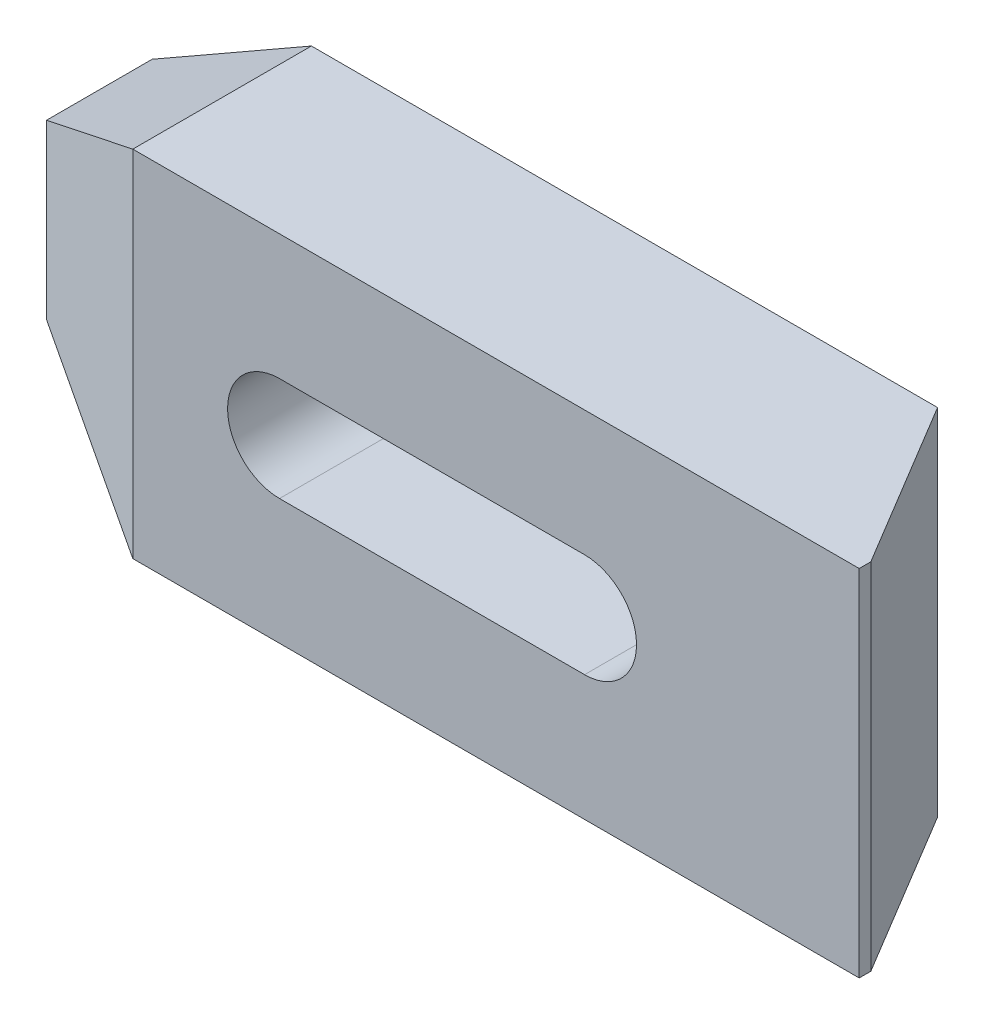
ISO-10303-21;
HEADER;
FILE_DESCRIPTION(('STEP AP214'),'2;1');
FILE_NAME('part.step','',(''),(''),'','','');
FILE_SCHEMA(('AUTOMOTIVE_DESIGN { 1 0 10303 214 1 1 1 1 }'));
ENDSEC;
DATA;
#1=APPLICATION_CONTEXT('core data for automotive mechanical design processes');
#2=APPLICATION_PROTOCOL_DEFINITION('international standard','automotive_design',2000,#1);
#3=PRODUCT_CONTEXT('',#1,'mechanical');
#4=PRODUCT('Part','Part','',(#3));
#5=PRODUCT_RELATED_PRODUCT_CATEGORY('part','',(#4));
#6=PRODUCT_DEFINITION_FORMATION('','',#4);
#7=PRODUCT_DEFINITION_CONTEXT('part definition',#1,'design');
#8=PRODUCT_DEFINITION('design','',#6,#7);
#9=PRODUCT_DEFINITION_SHAPE('','',#8);
#10=(LENGTH_UNIT() NAMED_UNIT(*) SI_UNIT(.MILLI.,.METRE.));
#11=(NAMED_UNIT(*) PLANE_ANGLE_UNIT() SI_UNIT($,.RADIAN.));
#12=(NAMED_UNIT(*) SI_UNIT($,.STERADIAN.) SOLID_ANGLE_UNIT());
#13=UNCERTAINTY_MEASURE_WITH_UNIT(LENGTH_MEASURE(1.E-05),#10,'distance_accuracy_value','');
#14=(GEOMETRIC_REPRESENTATION_CONTEXT(3) GLOBAL_UNCERTAINTY_ASSIGNED_CONTEXT((#13)) GLOBAL_UNIT_ASSIGNED_CONTEXT((#10,
#11,#12)) REPRESENTATION_CONTEXT('',''));
#15=CARTESIAN_POINT('',(0.,0.,0.));
#16=DIRECTION('',(0.,0.,1.));
#17=DIRECTION('',(1.,0.,0.));
#18=AXIS2_PLACEMENT_3D('',#15,#16,#17);
#19=CARTESIAN_POINT('',(0.,0.,12.446));
#20=DIRECTION('',(0.,0.,1.));
#21=DIRECTION('',(1.,0.,0.));
#22=AXIS2_PLACEMENT_3D('',#19,#20,#21);
#23=PLANE('',#22);
#24=DIRECTION('',(-1.,0.,0.));
#25=VECTOR('',#24,1.);
#26=CARTESIAN_POINT('',(53.73578153,12.3571,12.446));
#27=LINE('',#26,#25);
#28=CARTESIAN_POINT('',(104.35798153,12.3571,12.446));
#29=VERTEX_POINT('',#28);
#30=CARTESIAN_POINT('',(53.73578153,12.3571,12.446));
#31=VERTEX_POINT('',#30);
#32=EDGE_CURVE('E137',#29,#31,#27,.T.);
#33=ORIENTED_EDGE('',*,*,#32,.T.);
#34=DIRECTION('',(0.,-1.,0.));
#35=VECTOR('',#34,1.);
#36=CARTESIAN_POINT('',(53.7357815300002,-6.0071,12.446));
#37=LINE('',#36,#35);
#38=CARTESIAN_POINT('',(53.73578153,-12.3571,12.446));
#39=VERTEX_POINT('',#38);
#40=EDGE_CURVE('E139',#31,#39,#37,.T.);
#41=ORIENTED_EDGE('',*,*,#40,.T.);
#42=DIRECTION('',(1.,0.,0.));
#43=VECTOR('',#42,1.);
#44=CARTESIAN_POINT('',(53.73578153,-12.3571,12.446));
#45=LINE('',#44,#43);
#46=CARTESIAN_POINT('',(104.35798153,-12.3571,12.446));
#47=VERTEX_POINT('',#46);
#48=EDGE_CURVE('E173',#39,#47,#45,.T.);
#49=ORIENTED_EDGE('',*,*,#48,.T.);
#50=DIRECTION('',(0.,1.,0.));
#51=VECTOR('',#50,1.);
#52=CARTESIAN_POINT('',(104.35798153,12.3571,12.446));
#53=LINE('',#52,#51);
#54=EDGE_CURVE('E172',#47,#29,#53,.T.);
#55=ORIENTED_EDGE('',*,*,#54,.T.);
#56=EDGE_LOOP('',(#33,#41,#49,#55));
#57=FACE_BOUND('',#56,.T.);
#58=DIRECTION('',(1.,0.,0.));
#59=VECTOR('',#58,1.);
#60=CARTESIAN_POINT('',(85.21908153,-3.61949999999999,12.446));
#61=LINE('',#60,#59);
#62=CARTESIAN_POINT('',(63.95928153,-3.61949999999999,12.446));
#63=VERTEX_POINT('',#62);
#64=CARTESIAN_POINT('',(85.21908153,-3.61949999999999,12.446));
#65=VERTEX_POINT('',#64);
#66=EDGE_CURVE('E224',#63,#65,#61,.T.);
#67=ORIENTED_EDGE('',*,*,#66,.F.);
#68=CARTESIAN_POINT('',(63.95928153,0.,12.446));
#69=DIRECTION('',(0.,0.,1.));
#70=DIRECTION('',(1.,0.,0.));
#71=AXIS2_PLACEMENT_3D('',#68,#69,#70);
#72=CIRCLE('',#71,3.61949999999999);
#73=CARTESIAN_POINT('',(63.95928153,3.61949999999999,12.446));
#74=VERTEX_POINT('',#73);
#75=EDGE_CURVE('E210',#74,#63,#72,.T.);
#76=ORIENTED_EDGE('',*,*,#75,.F.);
#77=DIRECTION('',(-1.,0.,0.));
#78=VECTOR('',#77,1.);
#79=CARTESIAN_POINT('',(63.95928153,3.61949999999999,12.446));
#80=LINE('',#79,#78);
#81=CARTESIAN_POINT('',(85.21908153,3.61949999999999,12.446));
#82=VERTEX_POINT('',#81);
#83=EDGE_CURVE('E206',#82,#74,#80,.T.);
#84=ORIENTED_EDGE('',*,*,#83,.F.);
#85=CARTESIAN_POINT('',(85.21908153,0.,12.446));
#86=DIRECTION('',(0.,0.,1.));
#87=DIRECTION('',(1.,0.,0.));
#88=AXIS2_PLACEMENT_3D('',#85,#86,#87);
#89=CIRCLE('',#88,3.61949999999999);
#90=EDGE_CURVE('E221',#65,#82,#89,.T.);
#91=ORIENTED_EDGE('',*,*,#90,.F.);
#92=EDGE_LOOP('',(#67,#76,#84,#91));
#93=FACE_BOUND('',#92,.T.);
#94=ADVANCED_FACE('F35',(#57,#93),#23,.T.);
#95=CARTESIAN_POINT('',(0.,0.,0.));
#96=DIRECTION('',(0.,0.,1.));
#97=DIRECTION('',(1.,0.,0.));
#98=AXIS2_PLACEMENT_3D('',#95,#96,#97);
#99=PLANE('',#98);
#100=DIRECTION('',(-1.,0.,0.));
#101=VECTOR('',#100,1.);
#102=CARTESIAN_POINT('',(53.73578153,12.3571,0.));
#103=LINE('',#102,#101);
#104=CARTESIAN_POINT('',(97.37298153,12.3571,0.));
#105=VERTEX_POINT('',#104);
#106=CARTESIAN_POINT('',(53.73578153,12.3571,0.));
#107=VERTEX_POINT('',#106);
#108=EDGE_CURVE('E175',#105,#107,#103,.T.);
#109=ORIENTED_EDGE('',*,*,#108,.F.);
#110=DIRECTION('',(0.,-1.,0.));
#111=VECTOR('',#110,1.);
#112=CARTESIAN_POINT('',(97.37298153,12.3571,0.));
#113=LINE('',#112,#111);
#114=CARTESIAN_POINT('',(97.37298153,-12.3571,0.));
#115=VERTEX_POINT('',#114);
#116=EDGE_CURVE('E119',#105,#115,#113,.T.);
#117=ORIENTED_EDGE('',*,*,#116,.T.);
#118=DIRECTION('',(1.,0.,0.));
#119=VECTOR('',#118,1.);
#120=CARTESIAN_POINT('',(53.73578153,-12.3571,0.));
#121=LINE('',#120,#119);
#122=CARTESIAN_POINT('',(53.73578153,-12.3571,0.));
#123=VERTEX_POINT('',#122);
#124=EDGE_CURVE('E189',#123,#115,#121,.T.);
#125=ORIENTED_EDGE('',*,*,#124,.F.);
#126=DIRECTION('',(0.867998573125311,-0.496566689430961,0.));
#127=VECTOR('',#126,1.);
#128=CARTESIAN_POINT('',(42.6359815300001,-6.0071,0.));
#129=LINE('',#128,#127);
#130=CARTESIAN_POINT('',(42.6359815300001,-6.0071,0.));
#131=VERTEX_POINT('',#130);
#132=EDGE_CURVE('E187',#131,#123,#129,.T.);
#133=ORIENTED_EDGE('',*,*,#132,.F.);
#134=DIRECTION('',(0.,-1.,0.));
#135=VECTOR('',#134,1.);
#136=CARTESIAN_POINT('',(42.6359815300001,6.0071,0.));
#137=LINE('',#136,#135);
#138=CARTESIAN_POINT('',(42.6359815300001,6.0071,0.));
#139=VERTEX_POINT('',#138);
#140=EDGE_CURVE('E162',#139,#131,#137,.T.);
#141=ORIENTED_EDGE('',*,*,#140,.F.);
#142=DIRECTION('',(-0.867998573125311,-0.49656668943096,0.));
#143=VECTOR('',#142,1.);
#144=CARTESIAN_POINT('',(42.6359815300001,6.0071,0.));
#145=LINE('',#144,#143);
#146=EDGE_CURVE('E177',#107,#139,#145,.T.);
#147=ORIENTED_EDGE('',*,*,#146,.F.);
#148=EDGE_LOOP('',(#109,#117,#125,#133,#141,#147));
#149=FACE_BOUND('',#148,.T.);
#150=CARTESIAN_POINT('',(63.95928153,0.,0.));
#151=DIRECTION('',(0.,0.,1.));
#152=DIRECTION('',(1.,0.,0.));
#153=AXIS2_PLACEMENT_3D('',#150,#151,#152);
#154=CIRCLE('',#153,3.61949999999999);
#155=CARTESIAN_POINT('',(63.95928153,3.61949999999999,0.));
#156=VERTEX_POINT('',#155);
#157=CARTESIAN_POINT('',(63.95928153,-3.61949999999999,0.));
#158=VERTEX_POINT('',#157);
#159=EDGE_CURVE('E217',#156,#158,#154,.T.);
#160=ORIENTED_EDGE('',*,*,#159,.T.);
#161=DIRECTION('',(1.,0.,0.));
#162=VECTOR('',#161,1.);
#163=CARTESIAN_POINT('',(85.21908153,-3.61949999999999,0.));
#164=LINE('',#163,#162);
#165=CARTESIAN_POINT('',(85.21908153,-3.61949999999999,0.));
#166=VERTEX_POINT('',#165);
#167=EDGE_CURVE('E214',#158,#166,#164,.T.);
#168=ORIENTED_EDGE('',*,*,#167,.T.);
#169=CARTESIAN_POINT('',(85.21908153,0.,0.));
#170=DIRECTION('',(0.,0.,1.));
#171=DIRECTION('',(1.,0.,0.));
#172=AXIS2_PLACEMENT_3D('',#169,#170,#171);
#173=CIRCLE('',#172,3.61949999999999);
#174=CARTESIAN_POINT('',(85.21908153,3.61949999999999,0.));
#175=VERTEX_POINT('',#174);
#176=EDGE_CURVE('E211',#166,#175,#173,.T.);
#177=ORIENTED_EDGE('',*,*,#176,.T.);
#178=DIRECTION('',(-1.,0.,0.));
#179=VECTOR('',#178,1.);
#180=CARTESIAN_POINT('',(63.95928153,3.61949999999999,0.));
#181=LINE('',#180,#179);
#182=EDGE_CURVE('E207',#175,#156,#181,.T.);
#183=ORIENTED_EDGE('',*,*,#182,.T.);
#184=EDGE_LOOP('',(#160,#168,#177,#183));
#185=FACE_BOUND('',#184,.T.);
#186=ADVANCED_FACE('F193',(#149,#185),#99,.F.);
#187=CARTESIAN_POINT('',(104.35798153,12.3571,12.446));
#188=DIRECTION('',(-1.,0.,0.));
#189=DIRECTION('',(0.,-1.,0.));
#190=AXIS2_PLACEMENT_3D('',#187,#188,#189);
#191=PLANE('',#190);
#192=DIRECTION('',(0.,0.,-1.));
#193=VECTOR('',#192,1.);
#194=CARTESIAN_POINT('',(104.35798153,-12.3571,12.446));
#195=LINE('',#194,#193);
#196=CARTESIAN_POINT('',(104.35798153,-12.3571,11.6391443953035));
#197=VERTEX_POINT('',#196);
#198=EDGE_CURVE('E132',#47,#197,#195,.T.);
#199=ORIENTED_EDGE('',*,*,#198,.T.);
#200=DIRECTION('',(0.,-1.,0.));
#201=VECTOR('',#200,1.);
#202=CARTESIAN_POINT('',(104.35798153,12.3571,11.6391443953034));
#203=LINE('',#202,#201);
#204=CARTESIAN_POINT('',(104.35798153,12.3571,11.6391443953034));
#205=VERTEX_POINT('',#204);
#206=EDGE_CURVE('E51',#205,#197,#203,.T.);
#207=ORIENTED_EDGE('',*,*,#206,.F.);
#208=DIRECTION('',(0.,0.,-1.));
#209=VECTOR('',#208,1.);
#210=CARTESIAN_POINT('',(104.35798153,12.3571,12.446));
#211=LINE('',#210,#209);
#212=EDGE_CURVE('E130',#29,#205,#211,.T.);
#213=ORIENTED_EDGE('',*,*,#212,.F.);
#214=ORIENTED_EDGE('',*,*,#54,.F.);
#215=EDGE_LOOP('',(#199,#207,#213,#214));
#216=FACE_BOUND('',#215,.T.);
#217=ADVANCED_FACE('F128',(#216),#191,.F.);
#218=CARTESIAN_POINT('',(53.73578153,12.3571,12.446));
#219=DIRECTION('',(0.,-1.,0.));
#220=DIRECTION('',(1.,0.,0.));
#221=AXIS2_PLACEMENT_3D('',#218,#219,#220);
#222=PLANE('',#221);
#223=ORIENTED_EDGE('',*,*,#212,.T.);
#224=DIRECTION('',(-0.514577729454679,0.,-0.857443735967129));
#225=VECTOR('',#224,1.);
#226=CARTESIAN_POINT('',(104.35798153,12.3571,11.6391443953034));
#227=LINE('',#226,#225);
#228=EDGE_CURVE('E116',#205,#105,#227,.T.);
#229=ORIENTED_EDGE('',*,*,#228,.T.);
#230=ORIENTED_EDGE('',*,*,#108,.T.);
#231=DIRECTION('',(0.,0.,-1.));
#232=VECTOR('',#231,1.);
#233=CARTESIAN_POINT('',(53.73578153,12.3571,12.446));
#234=LINE('',#233,#232);
#235=EDGE_CURVE('E140',#31,#107,#234,.T.);
#236=ORIENTED_EDGE('',*,*,#235,.F.);
#237=ORIENTED_EDGE('',*,*,#32,.F.);
#238=EDGE_LOOP('',(#223,#229,#230,#236,#237));
#239=FACE_BOUND('',#238,.T.);
#240=ADVANCED_FACE('F134',(#239),#222,.F.);
#241=CARTESIAN_POINT('',(42.6359815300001,6.0071,12.446));
#242=DIRECTION('',(0.49656668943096,-0.867998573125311,0.));
#243=DIRECTION('',(0.867998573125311,0.49656668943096,0.));
#244=AXIS2_PLACEMENT_3D('',#241,#242,#243);
#245=PLANE('',#244);
#246=DIRECTION('',(0.,0.,-1.));
#247=VECTOR('',#246,1.);
#248=CARTESIAN_POINT('',(42.6359815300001,6.0071,12.446));
#249=LINE('',#248,#247);
#250=CARTESIAN_POINT('',(42.6359815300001,6.0071,7.36599999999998));
#251=VERTEX_POINT('',#250);
#252=EDGE_CURVE('E146',#251,#139,#249,.T.);
#253=ORIENTED_EDGE('',*,*,#252,.F.);
#254=DIRECTION('',(0.806678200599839,0.46148638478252,0.369189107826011));
#255=VECTOR('',#254,1.);
#256=CARTESIAN_POINT('',(49.1355914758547,9.72541232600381,10.340649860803));
#257=LINE('',#256,#255);
#258=EDGE_CURVE('E11',#251,#31,#257,.T.);
#259=ORIENTED_EDGE('',*,*,#258,.T.);
#260=ORIENTED_EDGE('',*,*,#235,.T.);
#261=ORIENTED_EDGE('',*,*,#146,.T.);
#262=EDGE_LOOP('',(#253,#259,#260,#261));
#263=FACE_BOUND('',#262,.T.);
#264=ADVANCED_FACE('F167',(#263),#245,.F.);
#265=CARTESIAN_POINT('',(42.6359815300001,6.0071,12.446));
#266=DIRECTION('',(1.,0.,0.));
#267=DIRECTION('',(0.,0.,-1.));
#268=AXIS2_PLACEMENT_3D('',#265,#266,#267);
#269=PLANE('',#268);
#270=DIRECTION('',(0.,0.,-1.));
#271=VECTOR('',#270,1.);
#272=CARTESIAN_POINT('',(42.6359815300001,-6.0071,12.446));
#273=LINE('',#272,#271);
#274=CARTESIAN_POINT('',(42.6359815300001,-6.0071,7.36599999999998));
#275=VERTEX_POINT('',#274);
#276=EDGE_CURVE('E153',#275,#131,#273,.T.);
#277=ORIENTED_EDGE('',*,*,#276,.F.);
#278=DIRECTION('',(0.,1.,0.));
#279=VECTOR('',#278,1.);
#280=CARTESIAN_POINT('',(42.6359815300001,6.0071,7.36599999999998));
#281=LINE('',#280,#279);
#282=EDGE_CURVE('E44',#275,#251,#281,.T.);
#283=ORIENTED_EDGE('',*,*,#282,.T.);
#284=ORIENTED_EDGE('',*,*,#252,.T.);
#285=ORIENTED_EDGE('',*,*,#140,.T.);
#286=EDGE_LOOP('',(#277,#283,#284,#285));
#287=FACE_BOUND('',#286,.T.);
#288=ADVANCED_FACE('F160',(#287),#269,.F.);
#289=CARTESIAN_POINT('',(42.6359815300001,-6.0071,12.446));
#290=DIRECTION('',(0.496566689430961,0.867998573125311,0.));
#291=DIRECTION('',(-0.867998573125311,0.496566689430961,0.));
#292=AXIS2_PLACEMENT_3D('',#289,#290,#291);
#293=PLANE('',#292);
#294=DIRECTION('',(0.,0.,-1.));
#295=VECTOR('',#294,1.);
#296=CARTESIAN_POINT('',(53.73578153,-12.3571,12.446));
#297=LINE('',#296,#295);
#298=EDGE_CURVE('E156',#39,#123,#297,.T.);
#299=ORIENTED_EDGE('',*,*,#298,.F.);
#300=DIRECTION('',(-0.806678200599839,0.461486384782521,-0.369189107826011));
#301=VECTOR('',#300,1.);
#302=CARTESIAN_POINT('',(49.1355914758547,-9.72541232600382,10.340649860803));
#303=LINE('',#302,#301);
#304=EDGE_CURVE('E143',#39,#275,#303,.T.);
#305=ORIENTED_EDGE('',*,*,#304,.T.);
#306=ORIENTED_EDGE('',*,*,#276,.T.);
#307=ORIENTED_EDGE('',*,*,#132,.T.);
#308=EDGE_LOOP('',(#299,#305,#306,#307));
#309=FACE_BOUND('',#308,.T.);
#310=ADVANCED_FACE('F152',(#309),#293,.F.);
#311=CARTESIAN_POINT('',(53.73578153,-12.3571,12.446));
#312=DIRECTION('',(0.,1.,0.));
#313=DIRECTION('',(-1.,0.,0.));
#314=AXIS2_PLACEMENT_3D('',#311,#312,#313);
#315=PLANE('',#314);
#316=ORIENTED_EDGE('',*,*,#124,.T.);
#317=DIRECTION('',(-0.514577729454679,0.,-0.857443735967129));
#318=VECTOR('',#317,1.);
#319=CARTESIAN_POINT('',(104.35798153,-12.3571,11.6391443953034));
#320=LINE('',#319,#318);
#321=EDGE_CURVE('E123',#197,#115,#320,.T.);
#322=ORIENTED_EDGE('',*,*,#321,.F.);
#323=ORIENTED_EDGE('',*,*,#198,.F.);
#324=ORIENTED_EDGE('',*,*,#48,.F.);
#325=ORIENTED_EDGE('',*,*,#298,.T.);
#326=EDGE_LOOP('',(#316,#322,#323,#324,#325));
#327=FACE_BOUND('',#326,.T.);
#328=ADVANCED_FACE('F197',(#327),#315,.F.);
#329=CARTESIAN_POINT('',(63.95928153,0.,12.446));
#330=DIRECTION('',(0.,0.,-1.));
#331=DIRECTION('',(-1.,0.,0.));
#332=AXIS2_PLACEMENT_3D('',#329,#330,#331);
#333=CYLINDRICAL_SURFACE('',#332,3.61949999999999);
#334=ORIENTED_EDGE('',*,*,#159,.F.);
#335=DIRECTION('',(0.,0.,-1.));
#336=VECTOR('',#335,1.);
#337=CARTESIAN_POINT('',(63.95928153,3.61949999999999,12.446));
#338=LINE('',#337,#336);
#339=EDGE_CURVE('E203',#74,#156,#338,.T.);
#340=ORIENTED_EDGE('',*,*,#339,.F.);
#341=ORIENTED_EDGE('',*,*,#75,.T.);
#342=DIRECTION('',(0.,0.,-1.));
#343=VECTOR('',#342,1.);
#344=CARTESIAN_POINT('',(63.95928153,-3.61949999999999,12.446));
#345=LINE('',#344,#343);
#346=EDGE_CURVE('E178',#63,#158,#345,.T.);
#347=ORIENTED_EDGE('',*,*,#346,.T.);
#348=EDGE_LOOP('',(#334,#340,#341,#347));
#349=FACE_BOUND('',#348,.T.);
#350=ADVANCED_FACE('F232',(#349),#333,.F.);
#351=CARTESIAN_POINT('',(85.21908153,-3.61949999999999,12.446));
#352=DIRECTION('',(0.,1.,0.));
#353=DIRECTION('',(0.,0.,1.));
#354=AXIS2_PLACEMENT_3D('',#351,#352,#353);
#355=PLANE('',#354);
#356=ORIENTED_EDGE('',*,*,#167,.F.);
#357=ORIENTED_EDGE('',*,*,#346,.F.);
#358=ORIENTED_EDGE('',*,*,#66,.T.);
#359=DIRECTION('',(0.,0.,-1.));
#360=VECTOR('',#359,1.);
#361=CARTESIAN_POINT('',(85.21908153,-3.61949999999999,12.446));
#362=LINE('',#361,#360);
#363=EDGE_CURVE('E182',#65,#166,#362,.T.);
#364=ORIENTED_EDGE('',*,*,#363,.T.);
#365=EDGE_LOOP('',(#356,#357,#358,#364));
#366=FACE_BOUND('',#365,.T.);
#367=ADVANCED_FACE('F236',(#366),#355,.T.);
#368=CARTESIAN_POINT('',(85.21908153,0.,12.446));
#369=DIRECTION('',(0.,0.,-1.));
#370=DIRECTION('',(-1.,0.,0.));
#371=AXIS2_PLACEMENT_3D('',#368,#369,#370);
#372=CYLINDRICAL_SURFACE('',#371,3.61949999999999);
#373=ORIENTED_EDGE('',*,*,#176,.F.);
#374=ORIENTED_EDGE('',*,*,#363,.F.);
#375=ORIENTED_EDGE('',*,*,#90,.T.);
#376=DIRECTION('',(0.,0.,-1.));
#377=VECTOR('',#376,1.);
#378=CARTESIAN_POINT('',(85.21908153,3.61949999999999,12.446));
#379=LINE('',#378,#377);
#380=EDGE_CURVE('E201',#82,#175,#379,.T.);
#381=ORIENTED_EDGE('',*,*,#380,.T.);
#382=EDGE_LOOP('',(#373,#374,#375,#381));
#383=FACE_BOUND('',#382,.T.);
#384=ADVANCED_FACE('F241',(#383),#372,.F.);
#385=CARTESIAN_POINT('',(63.95928153,3.61949999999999,12.446));
#386=DIRECTION('',(0.,-1.,0.));
#387=DIRECTION('',(0.,0.,-1.));
#388=AXIS2_PLACEMENT_3D('',#385,#386,#387);
#389=PLANE('',#388);
#390=ORIENTED_EDGE('',*,*,#182,.F.);
#391=ORIENTED_EDGE('',*,*,#380,.F.);
#392=ORIENTED_EDGE('',*,*,#83,.T.);
#393=ORIENTED_EDGE('',*,*,#339,.T.);
#394=EDGE_LOOP('',(#390,#391,#392,#393));
#395=FACE_BOUND('',#394,.T.);
#396=ADVANCED_FACE('F244',(#395),#389,.T.);
#397=CARTESIAN_POINT('',(53.7357815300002,0.,12.446));
#398=DIRECTION('',(-0.416153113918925,0.,0.909294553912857));
#399=DIRECTION('',(0.,1.,0.));
#400=AXIS2_PLACEMENT_3D('',#397,#398,#399);
#401=PLANE('',#400);
#402=ORIENTED_EDGE('',*,*,#258,.F.);
#403=ORIENTED_EDGE('',*,*,#282,.F.);
#404=ORIENTED_EDGE('',*,*,#304,.F.);
#405=ORIENTED_EDGE('',*,*,#40,.F.);
#406=EDGE_LOOP('',(#402,#403,#404,#405));
#407=FACE_BOUND('',#406,.T.);
#408=ADVANCED_FACE('F38',(#407),#401,.T.);
#409=CARTESIAN_POINT('',(104.35798153,12.3571,11.6391443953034));
#410=DIRECTION('',(-0.857443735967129,0.,0.514577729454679));
#411=DIRECTION('',(0.514577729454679,0.,0.857443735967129));
#412=AXIS2_PLACEMENT_3D('',#409,#410,#411);
#413=PLANE('',#412);
#414=ORIENTED_EDGE('',*,*,#321,.T.);
#415=ORIENTED_EDGE('',*,*,#116,.F.);
#416=ORIENTED_EDGE('',*,*,#228,.F.);
#417=ORIENTED_EDGE('',*,*,#206,.T.);
#418=EDGE_LOOP('',(#414,#415,#416,#417));
#419=FACE_BOUND('',#418,.T.);
#420=ADVANCED_FACE('F117',(#419),#413,.F.);
#421=CLOSED_SHELL('',(#94,#186,#217,#240,#264,#288,#310,#328,#350,#367,#384,#396,#408,#420));
#422=MANIFOLD_SOLID_BREP('B2',#421);
#423=ADVANCED_BREP_SHAPE_REPRESENTATION('',(#18,#422),#14);
#424=SHAPE_DEFINITION_REPRESENTATION(#9,#423);
ENDSEC;
END-ISO-10303-21;
